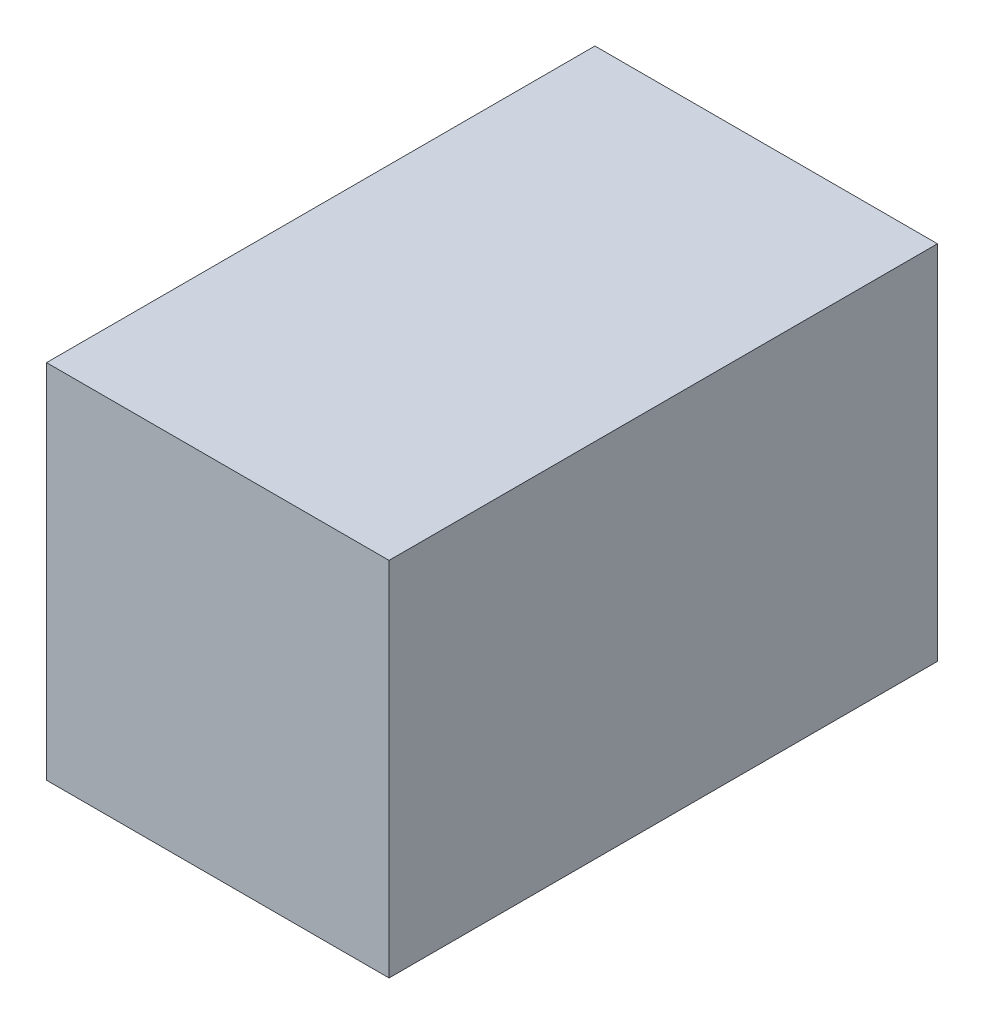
from build123d import *

# Parameters (mm, degrees)
SKETCH1_W      = 72.166451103
SKETCH1_H      = 115.542489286
EXTRUDE1_DEPTH = 38.1


with BuildPart() as part:
    # Sketch1 → Extrude1 (new, symmetric)
    with BuildSketch(Plane(origin=(0, 0, 0), x_dir=(1, 0, 0), z_dir=(0, 1, 0))):
        with Locations((1.578450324, -438.771244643)):
            Rectangle(SKETCH1_W, SKETCH1_H)
    extrude(amount=EXTRUDE1_DEPTH, both=True)


solid = part.part
